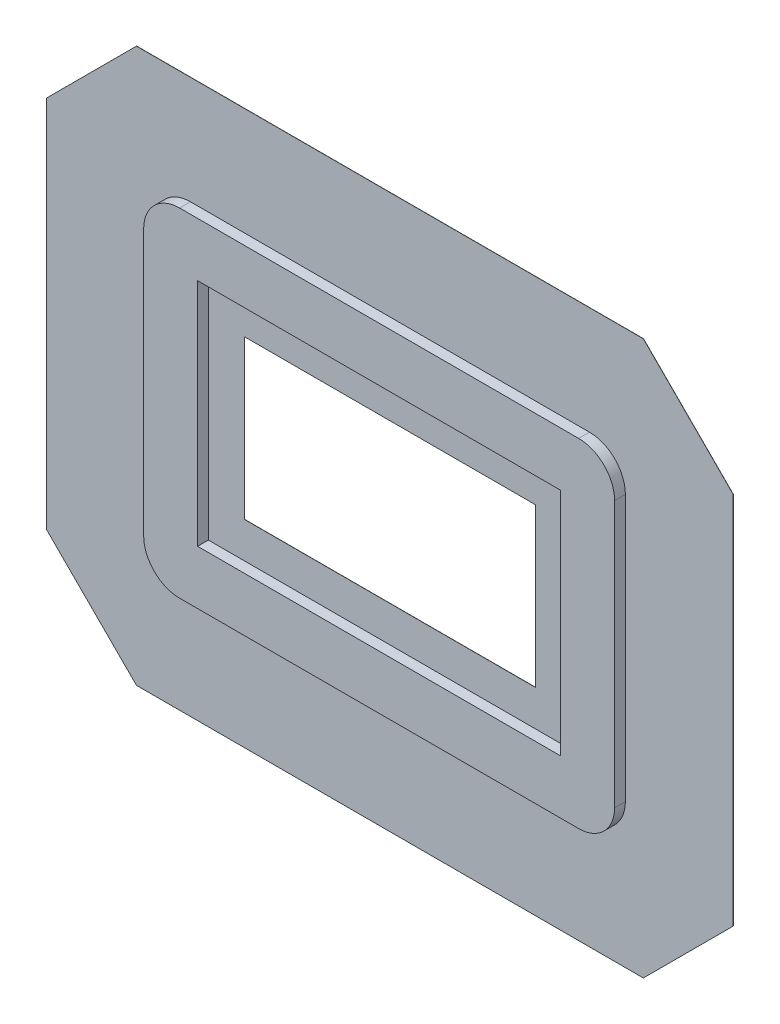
from build123d import *

# Parameters (mm, degrees)
ESQUISSE1_W        = 202
ESQUISSE1_H        = 128
EXTRU_MINCE1_DEPTH = 6
ESQUISSE2_W        = 382
ESQUISSE2_H        = 308
ESQUISSE2_W_2      = 162
ESQUISSE2_H_2      = 88
EXTRUSION1_DEPTH   = 0.1
CHANFREIN1_SIZE    = 50


with BuildPart() as part:
    # Esquisse1 → Extru.-Mince1 (new body)
    with BuildSketch(Plane.XY):
        with BuildLine():
            Line((-131, -74), (-131, 74))
            ThreePointArc((-131, 74), (-125.142135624, 88.142135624), (-111, 94))
            Line((-111, 94), (111, 94))
            ThreePointArc((111, 94), (125.142135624, 88.142135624), (131, 74))
            Line((131, 74), (131, -74))
            ThreePointArc((131, -74), (125.142135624, -88.142135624), (111, -94))
            Line((111, -94), (-111, -94))
            ThreePointArc((-111, -94), (-125.142135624, -88.142135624), (-131, -74))
        make_face()
        Rectangle(ESQUISSE1_W, ESQUISSE1_H, mode=Mode.SUBTRACT)
    extrude(amount=EXTRU_MINCE1_DEPTH)

    # Esquisse2 → Extrusion1 (add)
    with BuildSketch(Plane(origin=(0, 0, 0), x_dir=(-1, 0, 0), z_dir=(0, 0, -1))):
        Rectangle(ESQUISSE2_W, ESQUISSE2_H)
        Rectangle(ESQUISSE2_W_2, ESQUISSE2_H_2, mode=Mode.SUBTRACT)
    extrude(amount=EXTRUSION1_DEPTH)

    # Chanfrein1
    chanfrein1_edges = [part.edges().sort_by_distance(p)[0] for p in [
        (191, 154, -0.05),
        (191, -154, -0.05),
        (-191, -154, -0.05),
        (-191, 154, -0.05),
    ]]
    chamfer(chanfrein1_edges, length=CHANFREIN1_SIZE)


solid = part.part
